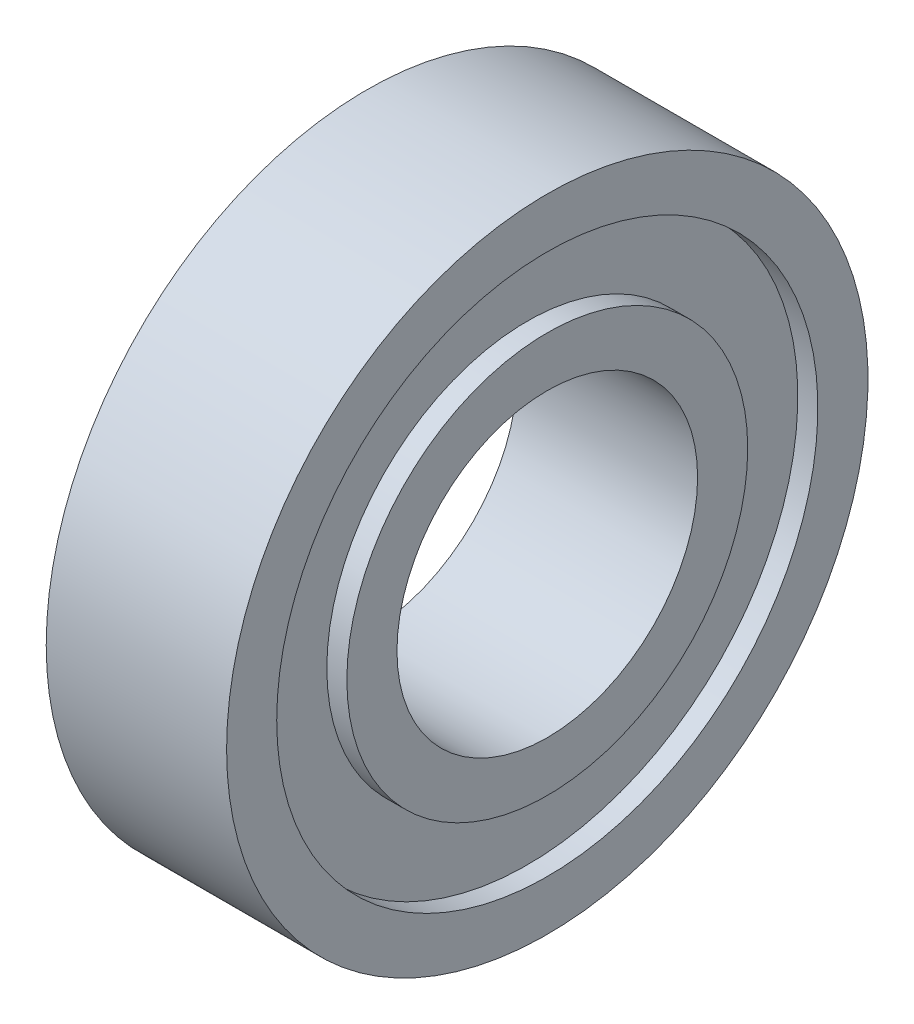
ISO-10303-21;
HEADER;
FILE_DESCRIPTION(('STEP AP214'),'2;1');
FILE_NAME('part.step','',(''),(''),'','','');
FILE_SCHEMA(('AUTOMOTIVE_DESIGN { 1 0 10303 214 1 1 1 1 }'));
ENDSEC;
DATA;
#1=APPLICATION_CONTEXT('core data for automotive mechanical design processes');
#2=APPLICATION_PROTOCOL_DEFINITION('international standard','automotive_design',2000,#1);
#3=PRODUCT_CONTEXT('',#1,'mechanical');
#4=PRODUCT('Part','Part','',(#3));
#5=PRODUCT_RELATED_PRODUCT_CATEGORY('part','',(#4));
#6=PRODUCT_DEFINITION_FORMATION('','',#4);
#7=PRODUCT_DEFINITION_CONTEXT('part definition',#1,'design');
#8=PRODUCT_DEFINITION('design','',#6,#7);
#9=PRODUCT_DEFINITION_SHAPE('','',#8);
#10=(LENGTH_UNIT() NAMED_UNIT(*) SI_UNIT(.MILLI.,.METRE.));
#11=(NAMED_UNIT(*) PLANE_ANGLE_UNIT() SI_UNIT($,.RADIAN.));
#12=(NAMED_UNIT(*) SI_UNIT($,.STERADIAN.) SOLID_ANGLE_UNIT());
#13=UNCERTAINTY_MEASURE_WITH_UNIT(LENGTH_MEASURE(1.E-05),#10,'distance_accuracy_value','');
#14=(GEOMETRIC_REPRESENTATION_CONTEXT(3) GLOBAL_UNCERTAINTY_ASSIGNED_CONTEXT((#13)) GLOBAL_UNIT_ASSIGNED_CONTEXT((#10,
#11,#12)) REPRESENTATION_CONTEXT('',''));
#15=CARTESIAN_POINT('',(0.,0.,0.));
#16=DIRECTION('',(0.,0.,1.));
#17=DIRECTION('',(1.,0.,0.));
#18=AXIS2_PLACEMENT_3D('',#15,#16,#17);
#19=CARTESIAN_POINT('',(0.,10.,-2.22044604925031E-13));
#20=DIRECTION('',(1.,0.,0.));
#21=DIRECTION('',(0.,0.,-1.));
#22=AXIS2_PLACEMENT_3D('',#19,#20,#21);
#23=PLANE('',#22);
#24=CARTESIAN_POINT('',(0.,-2.22044604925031E-13,1.11022302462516E-13));
#25=DIRECTION('',(-1.,0.,0.));
#26=DIRECTION('',(0.,0.,1.));
#27=AXIS2_PLACEMENT_3D('',#24,#25,#26);
#28=CIRCLE('',#27,7.5);
#29=CARTESIAN_POINT('',(0.,-2.22044604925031E-13,7.50000000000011));
#30=VERTEX_POINT('',#29);
#31=EDGE_CURVE('E10',#30,#30,#28,.T.);
#32=ORIENTED_EDGE('',*,*,#31,.F.);
#33=EDGE_LOOP('',(#32));
#34=FACE_BOUND('',#33,.T.);
#35=CARTESIAN_POINT('',(0.,-2.22044604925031E-13,1.11022302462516E-13));
#36=DIRECTION('',(-1.,0.,0.));
#37=DIRECTION('',(0.,0.,1.));
#38=AXIS2_PLACEMENT_3D('',#35,#36,#37);
#39=CIRCLE('',#38,10.);
#40=CARTESIAN_POINT('',(0.,-2.22044604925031E-13,10.0000000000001));
#41=VERTEX_POINT('',#40);
#42=EDGE_CURVE('E89',#41,#41,#39,.T.);
#43=ORIENTED_EDGE('',*,*,#42,.T.);
#44=EDGE_LOOP('',(#43));
#45=FACE_BOUND('',#44,.T.);
#46=ADVANCED_FACE('F38',(#34,#45),#23,.F.);
#47=CARTESIAN_POINT('',(0.,-2.22044604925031E-13,1.11022302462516E-13));
#48=DIRECTION('',(-1.,0.,0.));
#49=DIRECTION('',(0.,0.,1.));
#50=AXIS2_PLACEMENT_3D('',#47,#48,#49);
#51=CYLINDRICAL_SURFACE('',#50,7.5);
#52=CARTESIAN_POINT('',(9.00000000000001,-1.66533453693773E-13,0.));
#53=DIRECTION('',(-1.,0.,0.));
#54=DIRECTION('',(0.,0.,1.));
#55=AXIS2_PLACEMENT_3D('',#52,#53,#54);
#56=CIRCLE('',#55,7.5);
#57=CARTESIAN_POINT('',(9.00000000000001,-1.66533453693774E-13,7.5));
#58=VERTEX_POINT('',#57);
#59=EDGE_CURVE('E45',#58,#58,#56,.T.);
#60=ORIENTED_EDGE('',*,*,#59,.F.);
#61=EDGE_LOOP('',(#60));
#62=FACE_BOUND('',#61,.T.);
#63=ORIENTED_EDGE('',*,*,#31,.T.);
#64=EDGE_LOOP('',(#63));
#65=FACE_BOUND('',#64,.T.);
#66=ADVANCED_FACE('F151',(#62,#65),#51,.F.);
#67=CARTESIAN_POINT('',(9.00000000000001,7.50000000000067,-1.4432899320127E-12));
#68=DIRECTION('',(-1.,0.,0.));
#69=DIRECTION('',(0.,0.,1.));
#70=AXIS2_PLACEMENT_3D('',#67,#68,#69);
#71=PLANE('',#70);
#72=CARTESIAN_POINT('',(9.00000000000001,-1.66533453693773E-13,0.));
#73=DIRECTION('',(-1.,0.,0.));
#74=DIRECTION('',(0.,0.,1.));
#75=AXIS2_PLACEMENT_3D('',#72,#73,#74);
#76=CIRCLE('',#75,10.);
#77=CARTESIAN_POINT('',(9.00000000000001,-1.66533453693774E-13,10.));
#78=VERTEX_POINT('',#77);
#79=EDGE_CURVE('E52',#78,#78,#76,.T.);
#80=ORIENTED_EDGE('',*,*,#79,.F.);
#81=EDGE_LOOP('',(#80));
#82=FACE_BOUND('',#81,.T.);
#83=ORIENTED_EDGE('',*,*,#59,.T.);
#84=EDGE_LOOP('',(#83));
#85=FACE_BOUND('',#84,.T.);
#86=ADVANCED_FACE('F146',(#82,#85),#71,.F.);
#87=CARTESIAN_POINT('',(0.,-2.22044604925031E-13,1.11022302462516E-13));
#88=DIRECTION('',(-1.,0.,0.));
#89=DIRECTION('',(0.,0.,1.));
#90=AXIS2_PLACEMENT_3D('',#87,#88,#89);
#91=CYLINDRICAL_SURFACE('',#90,10.);
#92=CARTESIAN_POINT('',(8.00000000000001,-1.66533453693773E-13,0.));
#93=DIRECTION('',(-1.,0.,0.));
#94=DIRECTION('',(0.,0.,1.));
#95=AXIS2_PLACEMENT_3D('',#92,#93,#94);
#96=CIRCLE('',#95,10.);
#97=CARTESIAN_POINT('',(8.00000000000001,-1.66533453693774E-13,10.));
#98=VERTEX_POINT('',#97);
#99=EDGE_CURVE('E59',#98,#98,#96,.T.);
#100=ORIENTED_EDGE('',*,*,#99,.F.);
#101=EDGE_LOOP('',(#100));
#102=FACE_BOUND('',#101,.T.);
#103=ORIENTED_EDGE('',*,*,#79,.T.);
#104=EDGE_LOOP('',(#103));
#105=FACE_BOUND('',#104,.T.);
#106=ADVANCED_FACE('F140',(#102,#105),#91,.T.);
#107=CARTESIAN_POINT('',(8.00000000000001,10.0000000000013,-2.1094237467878E-12));
#108=DIRECTION('',(-1.,0.,0.));
#109=DIRECTION('',(0.,0.,1.));
#110=AXIS2_PLACEMENT_3D('',#107,#108,#109);
#111=PLANE('',#110);
#112=CARTESIAN_POINT('',(8.00000000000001,-1.66533453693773E-13,0.));
#113=DIRECTION('',(-1.,0.,0.));
#114=DIRECTION('',(0.,0.,1.));
#115=AXIS2_PLACEMENT_3D('',#112,#113,#114);
#116=CIRCLE('',#115,13.5);
#117=CARTESIAN_POINT('',(8.00000000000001,-1.66533453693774E-13,13.5));
#118=VERTEX_POINT('',#117);
#119=EDGE_CURVE('E65',#118,#118,#116,.T.);
#120=ORIENTED_EDGE('',*,*,#119,.F.);
#121=EDGE_LOOP('',(#120));
#122=FACE_BOUND('',#121,.T.);
#123=ORIENTED_EDGE('',*,*,#99,.T.);
#124=EDGE_LOOP('',(#123));
#125=FACE_BOUND('',#124,.T.);
#126=ADVANCED_FACE('F134',(#122,#125),#111,.F.);
#127=CARTESIAN_POINT('',(0.,-2.22044604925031E-13,1.11022302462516E-13));
#128=DIRECTION('',(-1.,0.,0.));
#129=DIRECTION('',(0.,0.,1.));
#130=AXIS2_PLACEMENT_3D('',#127,#128,#129);
#131=CYLINDRICAL_SURFACE('',#130,13.5);
#132=CARTESIAN_POINT('',(9.00000000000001,-1.66533453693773E-13,0.));
#133=DIRECTION('',(-1.,0.,0.));
#134=DIRECTION('',(0.,0.,1.));
#135=AXIS2_PLACEMENT_3D('',#132,#133,#134);
#136=CIRCLE('',#135,13.5);
#137=CARTESIAN_POINT('',(9.00000000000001,-1.66533453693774E-13,13.5));
#138=VERTEX_POINT('',#137);
#139=EDGE_CURVE('E69',#138,#138,#136,.T.);
#140=ORIENTED_EDGE('',*,*,#139,.F.);
#141=EDGE_LOOP('',(#140));
#142=FACE_BOUND('',#141,.T.);
#143=ORIENTED_EDGE('',*,*,#119,.T.);
#144=EDGE_LOOP('',(#143));
#145=FACE_BOUND('',#144,.T.);
#146=ADVANCED_FACE('F128',(#142,#145),#131,.F.);
#147=CARTESIAN_POINT('',(9.00000000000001,13.500000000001,-1.77635683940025E-12));
#148=DIRECTION('',(-1.,0.,0.));
#149=DIRECTION('',(0.,0.,1.));
#150=AXIS2_PLACEMENT_3D('',#147,#148,#149);
#151=PLANE('',#150);
#152=CARTESIAN_POINT('',(9.00000000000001,-1.66533453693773E-13,0.));
#153=DIRECTION('',(-1.,0.,0.));
#154=DIRECTION('',(0.,0.,1.));
#155=AXIS2_PLACEMENT_3D('',#152,#153,#154);
#156=CIRCLE('',#155,16.);
#157=CARTESIAN_POINT('',(9.00000000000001,-1.66533453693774E-13,16.));
#158=VERTEX_POINT('',#157);
#159=EDGE_CURVE('E72',#158,#158,#156,.T.);
#160=ORIENTED_EDGE('',*,*,#159,.F.);
#161=EDGE_LOOP('',(#160));
#162=FACE_BOUND('',#161,.T.);
#163=ORIENTED_EDGE('',*,*,#139,.T.);
#164=EDGE_LOOP('',(#163));
#165=FACE_BOUND('',#164,.T.);
#166=ADVANCED_FACE('F122',(#162,#165),#151,.F.);
#167=CARTESIAN_POINT('',(0.,-2.22044604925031E-13,1.11022302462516E-13));
#168=DIRECTION('',(-1.,0.,0.));
#169=DIRECTION('',(0.,0.,1.));
#170=AXIS2_PLACEMENT_3D('',#167,#168,#169);
#171=CYLINDRICAL_SURFACE('',#170,16.);
#172=CARTESIAN_POINT('',(0.,-2.22044604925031E-13,1.11022302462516E-13));
#173=DIRECTION('',(-1.,0.,0.));
#174=DIRECTION('',(0.,0.,1.));
#175=AXIS2_PLACEMENT_3D('',#172,#173,#174);
#176=CIRCLE('',#175,16.);
#177=CARTESIAN_POINT('',(0.,-2.22044604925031E-13,16.0000000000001));
#178=VERTEX_POINT('',#177);
#179=EDGE_CURVE('E76',#178,#178,#176,.T.);
#180=ORIENTED_EDGE('',*,*,#179,.F.);
#181=EDGE_LOOP('',(#180));
#182=FACE_BOUND('',#181,.T.);
#183=ORIENTED_EDGE('',*,*,#159,.T.);
#184=EDGE_LOOP('',(#183));
#185=FACE_BOUND('',#184,.T.);
#186=ADVANCED_FACE('F116',(#182,#185),#171,.T.);
#187=CARTESIAN_POINT('',(0.,15.9999999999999,1.11022302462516E-13));
#188=DIRECTION('',(1.,0.,0.));
#189=DIRECTION('',(0.,0.,-1.));
#190=AXIS2_PLACEMENT_3D('',#187,#188,#189);
#191=PLANE('',#190);
#192=CARTESIAN_POINT('',(0.,-2.22044604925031E-13,1.11022302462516E-13));
#193=DIRECTION('',(-1.,0.,0.));
#194=DIRECTION('',(0.,0.,1.));
#195=AXIS2_PLACEMENT_3D('',#192,#193,#194);
#196=CIRCLE('',#195,13.5);
#197=CARTESIAN_POINT('',(0.,-2.22044604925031E-13,13.5000000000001));
#198=VERTEX_POINT('',#197);
#199=EDGE_CURVE('E80',#198,#198,#196,.T.);
#200=ORIENTED_EDGE('',*,*,#199,.F.);
#201=EDGE_LOOP('',(#200));
#202=FACE_BOUND('',#201,.T.);
#203=ORIENTED_EDGE('',*,*,#179,.T.);
#204=EDGE_LOOP('',(#203));
#205=FACE_BOUND('',#204,.T.);
#206=ADVANCED_FACE('F110',(#202,#205),#191,.F.);
#207=CARTESIAN_POINT('',(0.,-2.22044604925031E-13,1.11022302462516E-13));
#208=DIRECTION('',(-1.,0.,0.));
#209=DIRECTION('',(0.,0.,1.));
#210=AXIS2_PLACEMENT_3D('',#207,#208,#209);
#211=CYLINDRICAL_SURFACE('',#210,13.5);
#212=CARTESIAN_POINT('',(1.,-2.22044604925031E-13,1.11022302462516E-13));
#213=DIRECTION('',(-1.,0.,0.));
#214=DIRECTION('',(0.,0.,1.));
#215=AXIS2_PLACEMENT_3D('',#212,#213,#214);
#216=CIRCLE('',#215,13.5);
#217=CARTESIAN_POINT('',(1.,-2.22044604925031E-13,13.5000000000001));
#218=VERTEX_POINT('',#217);
#219=EDGE_CURVE('E83',#218,#218,#216,.T.);
#220=ORIENTED_EDGE('',*,*,#219,.F.);
#221=EDGE_LOOP('',(#220));
#222=FACE_BOUND('',#221,.T.);
#223=ORIENTED_EDGE('',*,*,#199,.T.);
#224=EDGE_LOOP('',(#223));
#225=FACE_BOUND('',#224,.T.);
#226=ADVANCED_FACE('F104',(#222,#225),#211,.F.);
#227=CARTESIAN_POINT('',(1.,13.4999999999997,0.));
#228=DIRECTION('',(1.,0.,0.));
#229=DIRECTION('',(0.,0.,-1.));
#230=AXIS2_PLACEMENT_3D('',#227,#228,#229);
#231=PLANE('',#230);
#232=CARTESIAN_POINT('',(1.,-2.22044604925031E-13,1.11022302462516E-13));
#233=DIRECTION('',(-1.,0.,0.));
#234=DIRECTION('',(0.,0.,1.));
#235=AXIS2_PLACEMENT_3D('',#232,#233,#234);
#236=CIRCLE('',#235,10.);
#237=CARTESIAN_POINT('',(1.,-2.22044604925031E-13,10.0000000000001));
#238=VERTEX_POINT('',#237);
#239=EDGE_CURVE('E86',#238,#238,#236,.T.);
#240=ORIENTED_EDGE('',*,*,#239,.F.);
#241=EDGE_LOOP('',(#240));
#242=FACE_BOUND('',#241,.T.);
#243=ORIENTED_EDGE('',*,*,#219,.T.);
#244=EDGE_LOOP('',(#243));
#245=FACE_BOUND('',#244,.T.);
#246=ADVANCED_FACE('F98',(#242,#245),#231,.F.);
#247=CARTESIAN_POINT('',(0.,-2.22044604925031E-13,1.11022302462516E-13));
#248=DIRECTION('',(-1.,0.,0.));
#249=DIRECTION('',(0.,0.,1.));
#250=AXIS2_PLACEMENT_3D('',#247,#248,#249);
#251=CYLINDRICAL_SURFACE('',#250,10.);
#252=ORIENTED_EDGE('',*,*,#42,.F.);
#253=EDGE_LOOP('',(#252));
#254=FACE_BOUND('',#253,.T.);
#255=ORIENTED_EDGE('',*,*,#239,.T.);
#256=EDGE_LOOP('',(#255));
#257=FACE_BOUND('',#256,.T.);
#258=ADVANCED_FACE('F95',(#254,#257),#251,.T.);
#259=CLOSED_SHELL('',(#46,#66,#86,#106,#126,#146,#166,#186,#206,#226,#246,#258));
#260=MANIFOLD_SOLID_BREP('B2',#259);
#261=ADVANCED_BREP_SHAPE_REPRESENTATION('',(#18,#260),#14);
#262=SHAPE_DEFINITION_REPRESENTATION(#9,#261);
ENDSEC;
END-ISO-10303-21;
